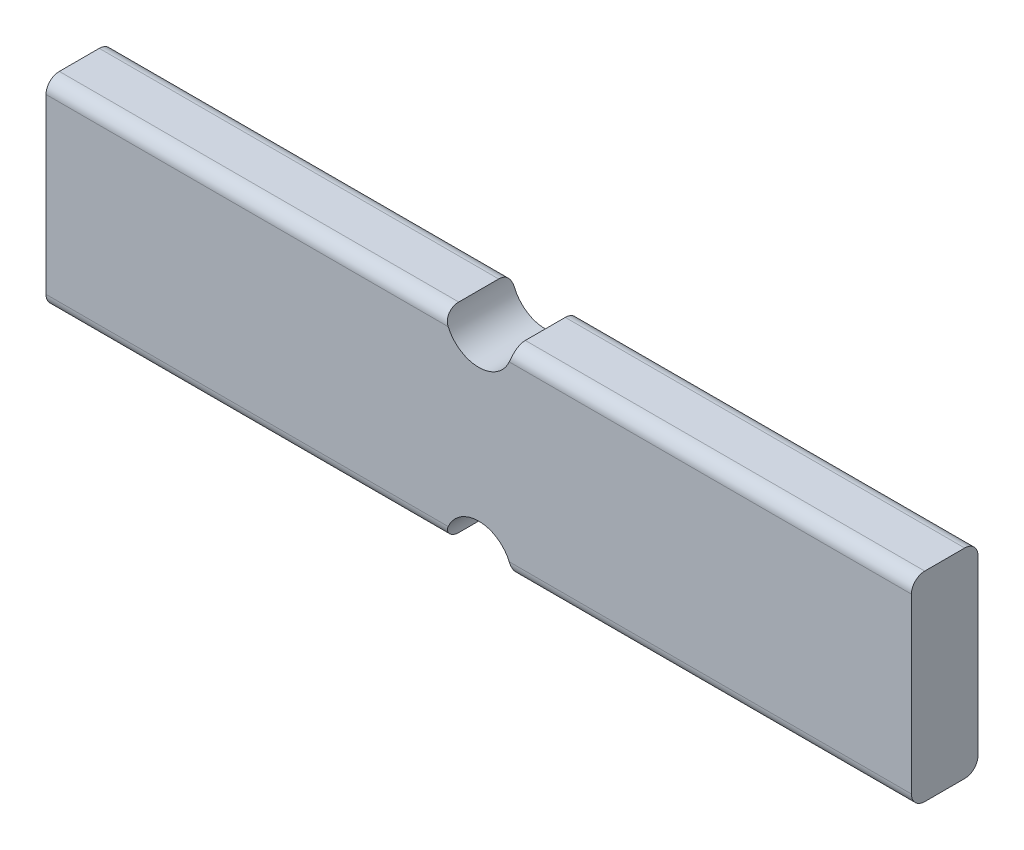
from build123d import *

# Parameters (mm, degrees)
EXTRUDE1_DEPTH = 12.7
FILLET1_R      = 2.54


with BuildPart() as part:
    # Sketch1 → Extrude1 (new body)
    with BuildSketch(Plane.XY):
        with BuildLine():
            Line((0, 0), (76.2, 0))
            ThreePointArc((76.2, 0), (82.55, 6.35), (88.9, 0))
            Line((88.9, 0), (165.1, 0))
            Line((165.1, 0), (165.1, 38.1))
            Line((165.1, 38.1), (88.9, 38.1))
            ThreePointArc((88.9, 38.1), (82.55, 31.75), (76.2, 38.1))
            Line((76.2, 38.1), (0, 38.1))
            Line((0, 38.1), (0, 0))
        make_face()
    extrude(amount=EXTRUDE1_DEPTH)

    # Fillet1
    fillet1_edges = [part.edges().sort_by_distance(p)[0] for p in [
        (127, 0, 12.7),
        (127, 38.1, 12.7),
        (38.1, 38.1, 12.7),
        (38.1, 38.1, 0),
        (38.1, 0, 12.7),
        (127, 38.1, 0),
        (127, 0, 0),
        (38.1, 0, 0),
    ]]
    fillet(fillet1_edges, radius=FILLET1_R)


solid = part.part
